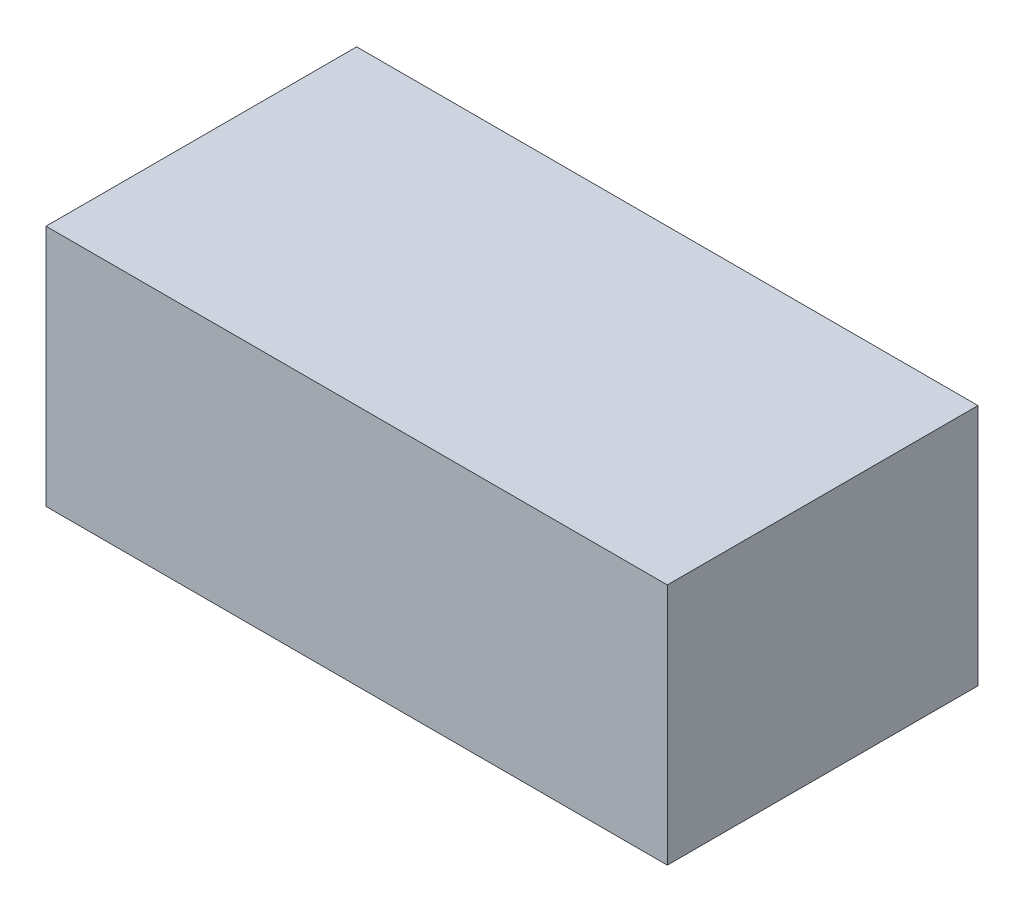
ISO-10303-21;
HEADER;
FILE_DESCRIPTION(('STEP AP214'),'2;1');
FILE_NAME('part.step','',(''),(''),'','','');
FILE_SCHEMA(('AUTOMOTIVE_DESIGN { 1 0 10303 214 1 1 1 1 }'));
ENDSEC;
DATA;
#1=APPLICATION_CONTEXT('core data for automotive mechanical design processes');
#2=APPLICATION_PROTOCOL_DEFINITION('international standard','automotive_design',2000,#1);
#3=PRODUCT_CONTEXT('',#1,'mechanical');
#4=PRODUCT('Part','Part','',(#3));
#5=PRODUCT_RELATED_PRODUCT_CATEGORY('part','',(#4));
#6=PRODUCT_DEFINITION_FORMATION('','',#4);
#7=PRODUCT_DEFINITION_CONTEXT('part definition',#1,'design');
#8=PRODUCT_DEFINITION('design','',#6,#7);
#9=PRODUCT_DEFINITION_SHAPE('','',#8);
#10=(LENGTH_UNIT() NAMED_UNIT(*) SI_UNIT(.MILLI.,.METRE.));
#11=(NAMED_UNIT(*) PLANE_ANGLE_UNIT() SI_UNIT($,.RADIAN.));
#12=(NAMED_UNIT(*) SI_UNIT($,.STERADIAN.) SOLID_ANGLE_UNIT());
#13=UNCERTAINTY_MEASURE_WITH_UNIT(LENGTH_MEASURE(1.E-05),#10,'distance_accuracy_value','');
#14=(GEOMETRIC_REPRESENTATION_CONTEXT(3) GLOBAL_UNCERTAINTY_ASSIGNED_CONTEXT((#13)) GLOBAL_UNIT_ASSIGNED_CONTEXT((#10,
#11,#12)) REPRESENTATION_CONTEXT('',''));
#15=CARTESIAN_POINT('',(0.,0.,0.));
#16=DIRECTION('',(0.,0.,1.));
#17=DIRECTION('',(1.,0.,0.));
#18=AXIS2_PLACEMENT_3D('',#15,#16,#17);
#19=CARTESIAN_POINT('',(3.2,0.,-1.6));
#20=DIRECTION('',(-1.,0.,0.));
#21=DIRECTION('',(0.,0.,1.));
#22=AXIS2_PLACEMENT_3D('',#19,#20,#21);
#23=PLANE('',#22);
#24=DIRECTION('',(0.,0.,-1.));
#25=VECTOR('',#24,1.);
#26=CARTESIAN_POINT('',(3.2,-1.25,-1.6));
#27=LINE('',#26,#25);
#28=CARTESIAN_POINT('',(3.2,-1.25,-1.6));
#29=VERTEX_POINT('',#28);
#30=CARTESIAN_POINT('',(3.2,-1.25,0.));
#31=VERTEX_POINT('',#30);
#32=EDGE_CURVE('E20',#29,#31,#27,.F.);
#33=ORIENTED_EDGE('',*,*,#32,.F.);
#34=DIRECTION('',(0.,1.,0.));
#35=VECTOR('',#34,1.);
#36=CARTESIAN_POINT('',(3.2,-1.25,-1.6));
#37=LINE('',#36,#35);
#38=CARTESIAN_POINT('',(3.2,0.,-1.6));
#39=VERTEX_POINT('',#38);
#40=EDGE_CURVE('E71',#39,#29,#37,.F.);
#41=ORIENTED_EDGE('',*,*,#40,.F.);
#42=DIRECTION('',(0.,0.,-1.));
#43=VECTOR('',#42,1.);
#44=CARTESIAN_POINT('',(3.2,0.,-1.6));
#45=LINE('',#44,#43);
#46=CARTESIAN_POINT('',(3.2,0.,0.));
#47=VERTEX_POINT('',#46);
#48=EDGE_CURVE('E74',#39,#47,#45,.F.);
#49=ORIENTED_EDGE('',*,*,#48,.T.);
#50=DIRECTION('',(0.,1.,0.));
#51=VECTOR('',#50,1.);
#52=CARTESIAN_POINT('',(3.2,-1.25,0.));
#53=LINE('',#52,#51);
#54=EDGE_CURVE('E67',#47,#31,#53,.F.);
#55=ORIENTED_EDGE('',*,*,#54,.T.);
#56=EDGE_LOOP('',(#33,#41,#49,#55));
#57=FACE_BOUND('',#56,.T.);
#58=ADVANCED_FACE('F17',(#57),#23,.F.);
#59=CARTESIAN_POINT('',(0.,-1.25,-1.6));
#60=DIRECTION('',(0.,-1.,0.));
#61=DIRECTION('',(0.,0.,-1.));
#62=AXIS2_PLACEMENT_3D('',#59,#60,#61);
#63=PLANE('',#62);
#64=DIRECTION('',(-1.,0.,0.));
#65=VECTOR('',#64,1.);
#66=CARTESIAN_POINT('',(3.2,-1.25,0.));
#67=LINE('',#66,#65);
#68=CARTESIAN_POINT('',(0.,-1.25,0.));
#69=VERTEX_POINT('',#68);
#70=EDGE_CURVE('E79',#31,#69,#67,.T.);
#71=ORIENTED_EDGE('',*,*,#70,.T.);
#72=DIRECTION('',(0.,0.,-1.));
#73=VECTOR('',#72,1.);
#74=CARTESIAN_POINT('',(0.,-1.25,-1.6));
#75=LINE('',#74,#73);
#76=CARTESIAN_POINT('',(0.,-1.25,-1.6));
#77=VERTEX_POINT('',#76);
#78=EDGE_CURVE('E65',#69,#77,#75,.T.);
#79=ORIENTED_EDGE('',*,*,#78,.T.);
#80=DIRECTION('',(-1.,0.,0.));
#81=VECTOR('',#80,1.);
#82=CARTESIAN_POINT('',(3.2,-1.25,-1.6));
#83=LINE('',#82,#81);
#84=EDGE_CURVE('E60',#29,#77,#83,.T.);
#85=ORIENTED_EDGE('',*,*,#84,.F.);
#86=ORIENTED_EDGE('',*,*,#32,.T.);
#87=EDGE_LOOP('',(#71,#79,#85,#86));
#88=FACE_BOUND('',#87,.T.);
#89=ADVANCED_FACE('F63',(#88),#63,.T.);
#90=CARTESIAN_POINT('',(3.2,-1.25,-1.6));
#91=DIRECTION('',(0.,0.,-1.));
#92=DIRECTION('',(-1.,0.,0.));
#93=AXIS2_PLACEMENT_3D('',#90,#91,#92);
#94=PLANE('',#93);
#95=ORIENTED_EDGE('',*,*,#84,.T.);
#96=DIRECTION('',(0.,1.,0.));
#97=VECTOR('',#96,1.);
#98=CARTESIAN_POINT('',(0.,-1.25,-1.6));
#99=LINE('',#98,#97);
#100=CARTESIAN_POINT('',(0.,0.,-1.6));
#101=VERTEX_POINT('',#100);
#102=EDGE_CURVE('E83',#77,#101,#99,.T.);
#103=ORIENTED_EDGE('',*,*,#102,.T.);
#104=DIRECTION('',(1.,0.,0.));
#105=VECTOR('',#104,1.);
#106=CARTESIAN_POINT('',(0.,0.,-1.6));
#107=LINE('',#106,#105);
#108=EDGE_CURVE('E54',#101,#39,#107,.T.);
#109=ORIENTED_EDGE('',*,*,#108,.T.);
#110=ORIENTED_EDGE('',*,*,#40,.T.);
#111=EDGE_LOOP('',(#95,#103,#109,#110));
#112=FACE_BOUND('',#111,.T.);
#113=ADVANCED_FACE('F73',(#112),#94,.T.);
#114=CARTESIAN_POINT('',(0.,0.,-1.6));
#115=DIRECTION('',(0.,-1.,0.));
#116=DIRECTION('',(0.,0.,-1.));
#117=AXIS2_PLACEMENT_3D('',#114,#115,#116);
#118=PLANE('',#117);
#119=ORIENTED_EDGE('',*,*,#108,.F.);
#120=DIRECTION('',(0.,0.,-1.));
#121=VECTOR('',#120,1.);
#122=CARTESIAN_POINT('',(0.,0.,-1.6));
#123=LINE('',#122,#121);
#124=CARTESIAN_POINT('',(0.,0.,0.));
#125=VERTEX_POINT('',#124);
#126=EDGE_CURVE('E26',#101,#125,#123,.F.);
#127=ORIENTED_EDGE('',*,*,#126,.T.);
#128=DIRECTION('',(-1.,0.,0.));
#129=VECTOR('',#128,1.);
#130=CARTESIAN_POINT('',(3.2,0.,0.));
#131=LINE('',#130,#129);
#132=EDGE_CURVE('E34',#125,#47,#131,.F.);
#133=ORIENTED_EDGE('',*,*,#132,.T.);
#134=ORIENTED_EDGE('',*,*,#48,.F.);
#135=EDGE_LOOP('',(#119,#127,#133,#134));
#136=FACE_BOUND('',#135,.T.);
#137=ADVANCED_FACE('F88',(#136),#118,.F.);
#138=CARTESIAN_POINT('',(3.2,-1.25,0.));
#139=DIRECTION('',(0.,0.,-1.));
#140=DIRECTION('',(-1.,0.,0.));
#141=AXIS2_PLACEMENT_3D('',#138,#139,#140);
#142=PLANE('',#141);
#143=ORIENTED_EDGE('',*,*,#132,.F.);
#144=DIRECTION('',(0.,1.,0.));
#145=VECTOR('',#144,1.);
#146=CARTESIAN_POINT('',(0.,-1.25,0.));
#147=LINE('',#146,#145);
#148=EDGE_CURVE('E11',#125,#69,#147,.F.);
#149=ORIENTED_EDGE('',*,*,#148,.T.);
#150=ORIENTED_EDGE('',*,*,#70,.F.);
#151=ORIENTED_EDGE('',*,*,#54,.F.);
#152=EDGE_LOOP('',(#143,#149,#150,#151));
#153=FACE_BOUND('',#152,.T.);
#154=ADVANCED_FACE('F91',(#153),#142,.F.);
#155=CARTESIAN_POINT('',(0.,-1.25,-1.6));
#156=DIRECTION('',(1.,0.,0.));
#157=DIRECTION('',(0.,0.,-1.));
#158=AXIS2_PLACEMENT_3D('',#155,#156,#157);
#159=PLANE('',#158);
#160=ORIENTED_EDGE('',*,*,#126,.F.);
#161=ORIENTED_EDGE('',*,*,#102,.F.);
#162=ORIENTED_EDGE('',*,*,#78,.F.);
#163=ORIENTED_EDGE('',*,*,#148,.F.);
#164=EDGE_LOOP('',(#160,#161,#162,#163));
#165=FACE_BOUND('',#164,.T.);
#166=ADVANCED_FACE('F90',(#165),#159,.F.);
#167=CLOSED_SHELL('',(#58,#89,#113,#137,#154,#166));
#168=MANIFOLD_SOLID_BREP('B1',#167);
#169=ADVANCED_BREP_SHAPE_REPRESENTATION('',(#18,#168),#14);
#170=SHAPE_DEFINITION_REPRESENTATION(#9,#169);
ENDSEC;
END-ISO-10303-21;
